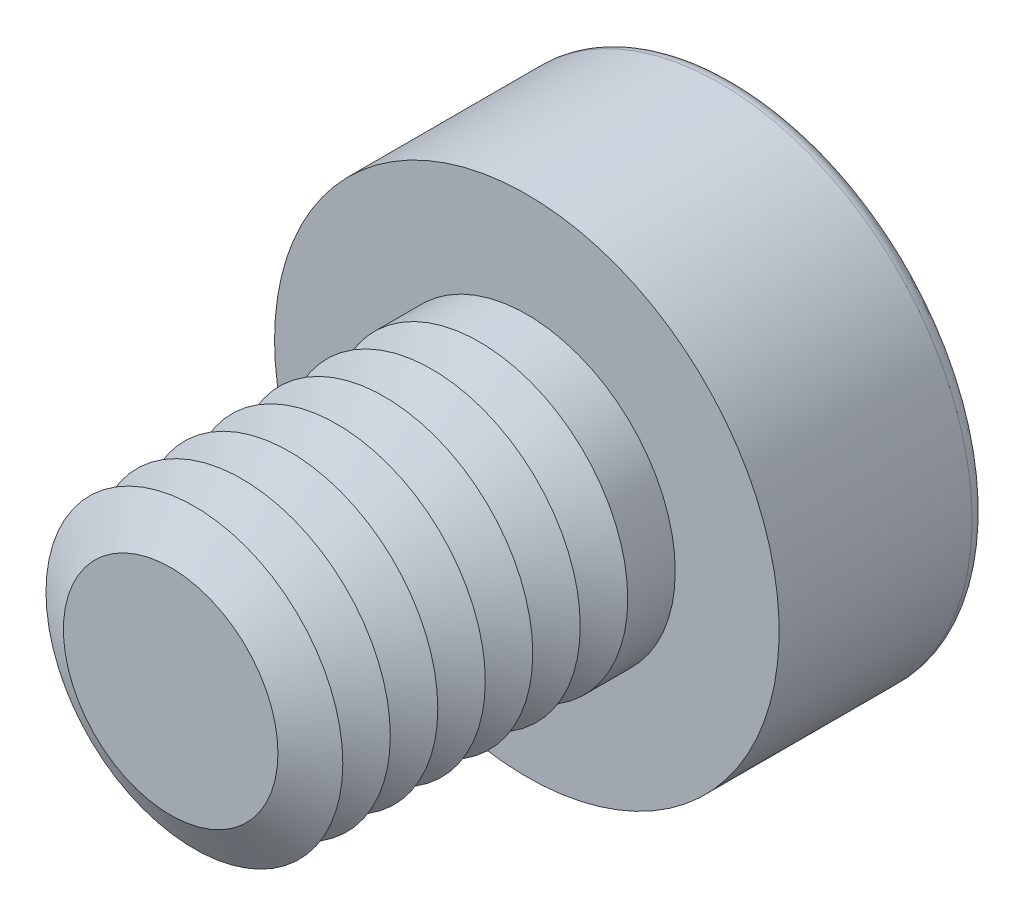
ISO-10303-21;
HEADER;
FILE_DESCRIPTION(('STEP AP214'),'2;1');
FILE_NAME('part.step','',(''),(''),'','','');
FILE_SCHEMA(('AUTOMOTIVE_DESIGN { 1 0 10303 214 1 1 1 1 }'));
ENDSEC;
DATA;
#1=APPLICATION_CONTEXT('core data for automotive mechanical design processes');
#2=APPLICATION_PROTOCOL_DEFINITION('international standard','automotive_design',2000,#1);
#3=PRODUCT_CONTEXT('',#1,'mechanical');
#4=PRODUCT('Part','Part','',(#3));
#5=PRODUCT_RELATED_PRODUCT_CATEGORY('part','',(#4));
#6=PRODUCT_DEFINITION_FORMATION('','',#4);
#7=PRODUCT_DEFINITION_CONTEXT('part definition',#1,'design');
#8=PRODUCT_DEFINITION('design','',#6,#7);
#9=PRODUCT_DEFINITION_SHAPE('','',#8);
#10=(LENGTH_UNIT() NAMED_UNIT(*) SI_UNIT(.MILLI.,.METRE.));
#11=(NAMED_UNIT(*) PLANE_ANGLE_UNIT() SI_UNIT($,.RADIAN.));
#12=(NAMED_UNIT(*) SI_UNIT($,.STERADIAN.) SOLID_ANGLE_UNIT());
#13=UNCERTAINTY_MEASURE_WITH_UNIT(LENGTH_MEASURE(1.E-05),#10,'distance_accuracy_value','');
#14=(GEOMETRIC_REPRESENTATION_CONTEXT(3) GLOBAL_UNCERTAINTY_ASSIGNED_CONTEXT((#13)) GLOBAL_UNIT_ASSIGNED_CONTEXT((#10,
#11,#12)) REPRESENTATION_CONTEXT('',''));
#15=CARTESIAN_POINT('',(0.,0.,0.));
#16=DIRECTION('',(0.,0.,1.));
#17=DIRECTION('',(1.,0.,0.));
#18=AXIS2_PLACEMENT_3D('',#15,#16,#17);
#19=CARTESIAN_POINT('',(0.,0.,3.2));
#20=DIRECTION('',(0.,0.,1.));
#21=DIRECTION('',(1.,0.,0.));
#22=AXIS2_PLACEMENT_3D('',#19,#20,#21);
#23=CONICAL_SURFACE('',#22,2.5,1.0471975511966);
#24=CARTESIAN_POINT('',(0.,0.,2.8));
#25=DIRECTION('',(0.,0.,1.));
#26=DIRECTION('',(1.,0.,0.));
#27=AXIS2_PLACEMENT_3D('',#24,#25,#26);
#28=CIRCLE('',#27,1.80717967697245);
#29=CARTESIAN_POINT('',(1.80717967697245,0.,2.8));
#30=VERTEX_POINT('',#29);
#31=EDGE_CURVE('E313',#30,#30,#28,.T.);
#32=ORIENTED_EDGE('',*,*,#31,.T.);
#33=EDGE_LOOP('',(#32));
#34=FACE_BOUND('',#33,.T.);
#35=CARTESIAN_POINT('',(0.,0.,3.2));
#36=DIRECTION('',(0.,0.,1.));
#37=DIRECTION('',(1.,0.,0.));
#38=AXIS2_PLACEMENT_3D('',#35,#36,#37);
#39=CIRCLE('',#38,2.5);
#40=CARTESIAN_POINT('',(2.5,0.,3.2));
#41=VERTEX_POINT('',#40);
#42=EDGE_CURVE('E315',#41,#41,#39,.T.);
#43=ORIENTED_EDGE('',*,*,#42,.F.);
#44=EDGE_LOOP('',(#43));
#45=FACE_BOUND('',#44,.T.);
#46=ADVANCED_FACE('F39',(#34,#45),#23,.T.);
#47=CARTESIAN_POINT('',(0.,0.,2.8));
#48=DIRECTION('',(0.,0.,-1.));
#49=DIRECTION('',(-1.,0.,0.));
#50=AXIS2_PLACEMENT_3D('',#47,#48,#49);
#51=CONICAL_SURFACE('',#50,1.80717967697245,1.04719755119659);
#52=CARTESIAN_POINT('',(0.,0.,2.4));
#53=DIRECTION('',(0.,0.,1.));
#54=DIRECTION('',(1.,0.,0.));
#55=AXIS2_PLACEMENT_3D('',#52,#53,#54);
#56=CIRCLE('',#55,2.5);
#57=CARTESIAN_POINT('',(2.5,0.,2.4));
#58=VERTEX_POINT('',#57);
#59=EDGE_CURVE('E323',#58,#58,#56,.T.);
#60=ORIENTED_EDGE('',*,*,#59,.T.);
#61=EDGE_LOOP('',(#60));
#62=FACE_BOUND('',#61,.T.);
#63=ORIENTED_EDGE('',*,*,#31,.F.);
#64=EDGE_LOOP('',(#63));
#65=FACE_BOUND('',#64,.T.);
#66=ADVANCED_FACE('F245',(#62,#65),#51,.T.);
#67=CARTESIAN_POINT('',(0.,0.,6.));
#68=DIRECTION('',(0.,0.,1.));
#69=DIRECTION('',(1.,0.,0.));
#70=AXIS2_PLACEMENT_3D('',#67,#68,#69);
#71=PLANE('',#70);
#72=CARTESIAN_POINT('',(0.,0.,6.));
#73=DIRECTION('',(0.,0.,1.));
#74=DIRECTION('',(1.,0.,0.));
#75=AXIS2_PLACEMENT_3D('',#72,#73,#74);
#76=CIRCLE('',#75,1.80717967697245);
#77=CARTESIAN_POINT('',(1.80717967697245,0.,6.));
#78=VERTEX_POINT('',#77);
#79=EDGE_CURVE('E174',#78,#78,#76,.T.);
#80=ORIENTED_EDGE('',*,*,#79,.T.);
#81=EDGE_LOOP('',(#80));
#82=FACE_BOUND('',#81,.T.);
#83=ADVANCED_FACE('F251',(#82),#71,.T.);
#84=CARTESIAN_POINT('',(0.,0.,6.));
#85=DIRECTION('',(0.,0.,-1.));
#86=DIRECTION('',(-1.,0.,0.));
#87=AXIS2_PLACEMENT_3D('',#84,#85,#86);
#88=CONICAL_SURFACE('',#87,1.80717967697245,1.04719755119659);
#89=CARTESIAN_POINT('',(0.,0.,5.6));
#90=DIRECTION('',(0.,0.,1.));
#91=DIRECTION('',(1.,0.,0.));
#92=AXIS2_PLACEMENT_3D('',#89,#90,#91);
#93=CIRCLE('',#92,2.5);
#94=CARTESIAN_POINT('',(2.5,0.,5.6));
#95=VERTEX_POINT('',#94);
#96=EDGE_CURVE('E291',#95,#95,#93,.T.);
#97=ORIENTED_EDGE('',*,*,#96,.T.);
#98=EDGE_LOOP('',(#97));
#99=FACE_BOUND('',#98,.T.);
#100=ORIENTED_EDGE('',*,*,#79,.F.);
#101=EDGE_LOOP('',(#100));
#102=FACE_BOUND('',#101,.T.);
#103=ADVANCED_FACE('F199',(#99,#102),#88,.T.);
#104=CARTESIAN_POINT('',(0.,0.,5.6));
#105=DIRECTION('',(0.,0.,1.));
#106=DIRECTION('',(1.,0.,0.));
#107=AXIS2_PLACEMENT_3D('',#104,#105,#106);
#108=CONICAL_SURFACE('',#107,2.5,1.0471975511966);
#109=CARTESIAN_POINT('',(0.,0.,5.2));
#110=DIRECTION('',(0.,0.,1.));
#111=DIRECTION('',(1.,0.,0.));
#112=AXIS2_PLACEMENT_3D('',#109,#110,#111);
#113=CIRCLE('',#112,1.80717967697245);
#114=CARTESIAN_POINT('',(1.80717967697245,0.,5.2));
#115=VERTEX_POINT('',#114);
#116=EDGE_CURVE('E288',#115,#115,#113,.T.);
#117=ORIENTED_EDGE('',*,*,#116,.T.);
#118=EDGE_LOOP('',(#117));
#119=FACE_BOUND('',#118,.T.);
#120=ORIENTED_EDGE('',*,*,#96,.F.);
#121=EDGE_LOOP('',(#120));
#122=FACE_BOUND('',#121,.T.);
#123=ADVANCED_FACE('F277',(#119,#122),#108,.T.);
#124=CARTESIAN_POINT('',(0.,0.,5.2));
#125=DIRECTION('',(0.,0.,-1.));
#126=DIRECTION('',(-1.,0.,0.));
#127=AXIS2_PLACEMENT_3D('',#124,#125,#126);
#128=CONICAL_SURFACE('',#127,1.80717967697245,1.04719755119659);
#129=CARTESIAN_POINT('',(0.,0.,4.8));
#130=DIRECTION('',(0.,0.,1.));
#131=DIRECTION('',(1.,0.,0.));
#132=AXIS2_PLACEMENT_3D('',#129,#130,#131);
#133=CIRCLE('',#132,2.5);
#134=CARTESIAN_POINT('',(2.5,0.,4.8));
#135=VERTEX_POINT('',#134);
#136=EDGE_CURVE('E299',#135,#135,#133,.T.);
#137=ORIENTED_EDGE('',*,*,#136,.T.);
#138=EDGE_LOOP('',(#137));
#139=FACE_BOUND('',#138,.T.);
#140=ORIENTED_EDGE('',*,*,#116,.F.);
#141=EDGE_LOOP('',(#140));
#142=FACE_BOUND('',#141,.T.);
#143=ADVANCED_FACE('F274',(#139,#142),#128,.T.);
#144=CARTESIAN_POINT('',(0.,0.,4.8));
#145=DIRECTION('',(0.,0.,1.));
#146=DIRECTION('',(1.,0.,0.));
#147=AXIS2_PLACEMENT_3D('',#144,#145,#146);
#148=CONICAL_SURFACE('',#147,2.5,1.0471975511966);
#149=CARTESIAN_POINT('',(0.,0.,4.4));
#150=DIRECTION('',(0.,0.,1.));
#151=DIRECTION('',(1.,0.,0.));
#152=AXIS2_PLACEMENT_3D('',#149,#150,#151);
#153=CIRCLE('',#152,1.80717967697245);
#154=CARTESIAN_POINT('',(1.80717967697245,0.,4.4));
#155=VERTEX_POINT('',#154);
#156=EDGE_CURVE('E293',#155,#155,#153,.T.);
#157=ORIENTED_EDGE('',*,*,#156,.T.);
#158=EDGE_LOOP('',(#157));
#159=FACE_BOUND('',#158,.T.);
#160=ORIENTED_EDGE('',*,*,#136,.F.);
#161=EDGE_LOOP('',(#160));
#162=FACE_BOUND('',#161,.T.);
#163=ADVANCED_FACE('F270',(#159,#162),#148,.T.);
#164=CARTESIAN_POINT('',(0.,0.,4.4));
#165=DIRECTION('',(0.,0.,-1.));
#166=DIRECTION('',(-1.,0.,0.));
#167=AXIS2_PLACEMENT_3D('',#164,#165,#166);
#168=CONICAL_SURFACE('',#167,1.80717967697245,1.04719755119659);
#169=CARTESIAN_POINT('',(0.,0.,4.));
#170=DIRECTION('',(0.,0.,1.));
#171=DIRECTION('',(1.,0.,0.));
#172=AXIS2_PLACEMENT_3D('',#169,#170,#171);
#173=CIRCLE('',#172,2.5);
#174=CARTESIAN_POINT('',(2.5,0.,4.));
#175=VERTEX_POINT('',#174);
#176=EDGE_CURVE('E309',#175,#175,#173,.T.);
#177=ORIENTED_EDGE('',*,*,#176,.T.);
#178=EDGE_LOOP('',(#177));
#179=FACE_BOUND('',#178,.T.);
#180=ORIENTED_EDGE('',*,*,#156,.F.);
#181=EDGE_LOOP('',(#180));
#182=FACE_BOUND('',#181,.T.);
#183=ADVANCED_FACE('F266',(#179,#182),#168,.T.);
#184=CARTESIAN_POINT('',(0.,0.,4.));
#185=DIRECTION('',(0.,0.,1.));
#186=DIRECTION('',(1.,0.,0.));
#187=AXIS2_PLACEMENT_3D('',#184,#185,#186);
#188=CONICAL_SURFACE('',#187,2.5,1.0471975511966);
#189=CARTESIAN_POINT('',(0.,0.,3.6));
#190=DIRECTION('',(0.,0.,1.));
#191=DIRECTION('',(1.,0.,0.));
#192=AXIS2_PLACEMENT_3D('',#189,#190,#191);
#193=CIRCLE('',#192,1.80717967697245);
#194=CARTESIAN_POINT('',(1.80717967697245,0.,3.6));
#195=VERTEX_POINT('',#194);
#196=EDGE_CURVE('E305',#195,#195,#193,.T.);
#197=ORIENTED_EDGE('',*,*,#196,.T.);
#198=EDGE_LOOP('',(#197));
#199=FACE_BOUND('',#198,.T.);
#200=ORIENTED_EDGE('',*,*,#176,.F.);
#201=EDGE_LOOP('',(#200));
#202=FACE_BOUND('',#201,.T.);
#203=ADVANCED_FACE('F262',(#199,#202),#188,.T.);
#204=CARTESIAN_POINT('',(0.,0.,3.6));
#205=DIRECTION('',(0.,0.,-1.));
#206=DIRECTION('',(-1.,0.,0.));
#207=AXIS2_PLACEMENT_3D('',#204,#205,#206);
#208=CONICAL_SURFACE('',#207,1.80717967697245,1.04719755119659);
#209=ORIENTED_EDGE('',*,*,#42,.T.);
#210=EDGE_LOOP('',(#209));
#211=FACE_BOUND('',#210,.T.);
#212=ORIENTED_EDGE('',*,*,#196,.F.);
#213=EDGE_LOOP('',(#212));
#214=FACE_BOUND('',#213,.T.);
#215=ADVANCED_FACE('F258',(#211,#214),#208,.T.);
#216=CARTESIAN_POINT('',(0.,0.,2.4));
#217=DIRECTION('',(0.,0.,1.));
#218=DIRECTION('',(1.,0.,0.));
#219=AXIS2_PLACEMENT_3D('',#216,#217,#218);
#220=CONICAL_SURFACE('',#219,2.5,1.0471975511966);
#221=CARTESIAN_POINT('',(0.,0.,2.));
#222=DIRECTION('',(0.,0.,1.));
#223=DIRECTION('',(1.,0.,0.));
#224=AXIS2_PLACEMENT_3D('',#221,#222,#223);
#225=CIRCLE('',#224,1.80717967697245);
#226=CARTESIAN_POINT('',(1.80717967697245,0.,2.));
#227=VERTEX_POINT('',#226);
#228=EDGE_CURVE('E319',#227,#227,#225,.T.);
#229=ORIENTED_EDGE('',*,*,#228,.T.);
#230=EDGE_LOOP('',(#229));
#231=FACE_BOUND('',#230,.T.);
#232=ORIENTED_EDGE('',*,*,#59,.F.);
#233=EDGE_LOOP('',(#232));
#234=FACE_BOUND('',#233,.T.);
#235=ADVANCED_FACE('F261',(#231,#234),#220,.T.);
#236=CARTESIAN_POINT('',(0.,0.,2.));
#237=DIRECTION('',(0.,0.,-1.));
#238=DIRECTION('',(-1.,0.,0.));
#239=AXIS2_PLACEMENT_3D('',#236,#237,#238);
#240=CONICAL_SURFACE('',#239,1.80717967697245,1.04719755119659);
#241=CARTESIAN_POINT('',(0.,0.,1.6));
#242=DIRECTION('',(0.,0.,1.));
#243=DIRECTION('',(1.,0.,0.));
#244=AXIS2_PLACEMENT_3D('',#241,#242,#243);
#245=CIRCLE('',#244,2.5);
#246=CARTESIAN_POINT('',(2.5,0.,1.6));
#247=VERTEX_POINT('',#246);
#248=EDGE_CURVE('E335',#247,#247,#245,.T.);
#249=ORIENTED_EDGE('',*,*,#248,.T.);
#250=EDGE_LOOP('',(#249));
#251=FACE_BOUND('',#250,.T.);
#252=ORIENTED_EDGE('',*,*,#228,.F.);
#253=EDGE_LOOP('',(#252));
#254=FACE_BOUND('',#253,.T.);
#255=ADVANCED_FACE('F341',(#251,#254),#240,.T.);
#256=CARTESIAN_POINT('',(0.,0.,1.6));
#257=DIRECTION('',(0.,0.,1.));
#258=DIRECTION('',(1.,0.,0.));
#259=AXIS2_PLACEMENT_3D('',#256,#257,#258);
#260=CONICAL_SURFACE('',#259,2.5,1.0471975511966);
#261=CARTESIAN_POINT('',(0.,0.,1.2));
#262=DIRECTION('',(0.,0.,1.));
#263=DIRECTION('',(1.,0.,0.));
#264=AXIS2_PLACEMENT_3D('',#261,#262,#263);
#265=CIRCLE('',#264,1.80717967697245);
#266=CARTESIAN_POINT('',(1.80717967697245,0.,1.2));
#267=VERTEX_POINT('',#266);
#268=EDGE_CURVE('E327',#267,#267,#265,.T.);
#269=ORIENTED_EDGE('',*,*,#268,.T.);
#270=EDGE_LOOP('',(#269));
#271=FACE_BOUND('',#270,.T.);
#272=ORIENTED_EDGE('',*,*,#248,.F.);
#273=EDGE_LOOP('',(#272));
#274=FACE_BOUND('',#273,.T.);
#275=ADVANCED_FACE('F344',(#271,#274),#260,.T.);
#276=CARTESIAN_POINT('',(0.,0.,1.2));
#277=DIRECTION('',(0.,0.,-1.));
#278=DIRECTION('',(-1.,0.,0.));
#279=AXIS2_PLACEMENT_3D('',#276,#277,#278);
#280=CONICAL_SURFACE('',#279,1.80717967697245,1.04719755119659);
#281=CARTESIAN_POINT('',(0.,0.,0.799999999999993));
#282=DIRECTION('',(0.,0.,1.));
#283=DIRECTION('',(1.,0.,0.));
#284=AXIS2_PLACEMENT_3D('',#281,#282,#283);
#285=CIRCLE('',#284,2.5);
#286=CARTESIAN_POINT('',(2.5,0.,0.799999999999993));
#287=VERTEX_POINT('',#286);
#288=EDGE_CURVE('E331',#287,#287,#285,.T.);
#289=ORIENTED_EDGE('',*,*,#288,.T.);
#290=EDGE_LOOP('',(#289));
#291=FACE_BOUND('',#290,.T.);
#292=ORIENTED_EDGE('',*,*,#268,.F.);
#293=EDGE_LOOP('',(#292));
#294=FACE_BOUND('',#293,.T.);
#295=ADVANCED_FACE('F346',(#291,#294),#280,.T.);
#296=CARTESIAN_POINT('',(0.,0.,-1.25));
#297=DIRECTION('',(0.,0.,-1.));
#298=DIRECTION('',(-1.,0.,0.));
#299=AXIS2_PLACEMENT_3D('',#296,#297,#298);
#300=CONICAL_SURFACE('',#299,1.5,1.0471975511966);
#301=CARTESIAN_POINT('',(0.,0.,-0.383974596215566));
#302=VERTEX_POINT('',#301);
#303=VERTEX_LOOP('',#302);
#304=FACE_BOUND('',#303,.T.);
#305=CARTESIAN_POINT('',(0.,0.,-1.25));
#306=DIRECTION('',(0.,0.,-1.));
#307=DIRECTION('',(-1.,0.,0.));
#308=AXIS2_PLACEMENT_3D('',#305,#306,#307);
#309=CIRCLE('',#308,1.5);
#310=CARTESIAN_POINT('',(-1.29903810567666,0.75,-1.25));
#311=VERTEX_POINT('',#310);
#312=CARTESIAN_POINT('',(0.,1.5,-1.25));
#313=VERTEX_POINT('',#312);
#314=EDGE_CURVE('E149',#311,#313,#309,.T.);
#315=ORIENTED_EDGE('',*,*,#314,.T.);
#316=CARTESIAN_POINT('',(0.,0.,-1.25));
#317=DIRECTION('',(0.,0.,-1.));
#318=DIRECTION('',(-1.,0.,0.));
#319=AXIS2_PLACEMENT_3D('',#316,#317,#318);
#320=CIRCLE('',#319,1.5);
#321=CARTESIAN_POINT('',(1.29903810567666,0.75,-1.25));
#322=VERTEX_POINT('',#321);
#323=EDGE_CURVE('E54',#313,#322,#320,.T.);
#324=ORIENTED_EDGE('',*,*,#323,.T.);
#325=CARTESIAN_POINT('',(1.29903810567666,-0.749999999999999,-1.25));
#326=VERTEX_POINT('',#325);
#327=EDGE_CURVE('E725',#322,#326,#320,.T.);
#328=ORIENTED_EDGE('',*,*,#327,.T.);
#329=CARTESIAN_POINT('',(0.,-1.5,-1.25));
#330=VERTEX_POINT('',#329);
#331=EDGE_CURVE('E724',#326,#330,#320,.T.);
#332=ORIENTED_EDGE('',*,*,#331,.T.);
#333=CARTESIAN_POINT('',(-1.29903810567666,-0.75,-1.25));
#334=VERTEX_POINT('',#333);
#335=EDGE_CURVE('E719',#330,#334,#320,.T.);
#336=ORIENTED_EDGE('',*,*,#335,.T.);
#337=EDGE_CURVE('E717',#334,#311,#320,.T.);
#338=ORIENTED_EDGE('',*,*,#337,.T.);
#339=EDGE_LOOP('',(#315,#324,#328,#332,#336,#338));
#340=FACE_BOUND('',#339,.T.);
#341=ADVANCED_FACE('F201',(#304,#340),#300,.F.);
#342=CARTESIAN_POINT('',(0.,0.,-1.25));
#343=DIRECTION('',(0.,0.,-1.));
#344=DIRECTION('',(-1.,0.,0.));
#345=AXIS2_PLACEMENT_3D('',#342,#343,#344);
#346=PLANE('',#345);
#347=ORIENTED_EDGE('',*,*,#323,.F.);
#348=DIRECTION('',(1.,0.,0.));
#349=VECTOR('',#348,1.);
#350=CARTESIAN_POINT('',(-0.86602540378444,1.5,-1.25));
#351=LINE('',#350,#349);
#352=CARTESIAN_POINT('',(0.866025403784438,1.5,-1.25));
#353=VERTEX_POINT('',#352);
#354=EDGE_CURVE('E769',#313,#353,#351,.T.);
#355=ORIENTED_EDGE('',*,*,#354,.T.);
#356=DIRECTION('',(0.5,-0.866025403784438,0.));
#357=VECTOR('',#356,1.);
#358=CARTESIAN_POINT('',(0.866025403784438,1.5,-1.25));
#359=LINE('',#358,#357);
#360=EDGE_CURVE('E155',#353,#322,#359,.T.);
#361=ORIENTED_EDGE('',*,*,#360,.T.);
#362=EDGE_LOOP('',(#347,#355,#361));
#363=FACE_BOUND('',#362,.T.);
#364=ADVANCED_FACE('F386',(#363),#346,.T.);
#365=ORIENTED_EDGE('',*,*,#327,.F.);
#366=CARTESIAN_POINT('',(1.73205080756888,0.,-1.25));
#367=VERTEX_POINT('',#366);
#368=EDGE_CURVE('E765',#322,#367,#359,.T.);
#369=ORIENTED_EDGE('',*,*,#368,.T.);
#370=DIRECTION('',(-0.5,-0.866025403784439,0.));
#371=VECTOR('',#370,1.);
#372=CARTESIAN_POINT('',(1.73205080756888,0.,-1.25));
#373=LINE('',#372,#371);
#374=EDGE_CURVE('E738',#367,#326,#373,.T.);
#375=ORIENTED_EDGE('',*,*,#374,.T.);
#376=EDGE_LOOP('',(#365,#369,#375));
#377=FACE_BOUND('',#376,.T.);
#378=ADVANCED_FACE('F396',(#377),#346,.T.);
#379=ORIENTED_EDGE('',*,*,#331,.F.);
#380=CARTESIAN_POINT('',(0.866025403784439,-1.5,-1.25));
#381=VERTEX_POINT('',#380);
#382=EDGE_CURVE('E740',#326,#381,#373,.T.);
#383=ORIENTED_EDGE('',*,*,#382,.T.);
#384=DIRECTION('',(-1.,0.,0.));
#385=VECTOR('',#384,1.);
#386=CARTESIAN_POINT('',(0.866025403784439,-1.5,-1.25));
#387=LINE('',#386,#385);
#388=EDGE_CURVE('E695',#381,#330,#387,.T.);
#389=ORIENTED_EDGE('',*,*,#388,.T.);
#390=EDGE_LOOP('',(#379,#383,#389));
#391=FACE_BOUND('',#390,.T.);
#392=ADVANCED_FACE('F406',(#391),#346,.T.);
#393=ORIENTED_EDGE('',*,*,#335,.F.);
#394=CARTESIAN_POINT('',(-0.866025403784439,-1.5,-1.25));
#395=VERTEX_POINT('',#394);
#396=EDGE_CURVE('E735',#330,#395,#387,.T.);
#397=ORIENTED_EDGE('',*,*,#396,.T.);
#398=DIRECTION('',(-0.5,0.866025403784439,0.));
#399=VECTOR('',#398,1.);
#400=CARTESIAN_POINT('',(-0.866025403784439,-1.5,-1.25));
#401=LINE('',#400,#399);
#402=EDGE_CURVE('E737',#395,#334,#401,.T.);
#403=ORIENTED_EDGE('',*,*,#402,.T.);
#404=EDGE_LOOP('',(#393,#397,#403));
#405=FACE_BOUND('',#404,.T.);
#406=ADVANCED_FACE('F414',(#405),#346,.T.);
#407=ORIENTED_EDGE('',*,*,#337,.F.);
#408=CARTESIAN_POINT('',(-1.73205080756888,0.,-1.25));
#409=VERTEX_POINT('',#408);
#410=EDGE_CURVE('E742',#334,#409,#401,.T.);
#411=ORIENTED_EDGE('',*,*,#410,.T.);
#412=DIRECTION('',(0.5,0.866025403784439,0.));
#413=VECTOR('',#412,1.);
#414=CARTESIAN_POINT('',(-1.73205080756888,0.,-1.25));
#415=LINE('',#414,#413);
#416=EDGE_CURVE('E158',#409,#311,#415,.T.);
#417=ORIENTED_EDGE('',*,*,#416,.T.);
#418=EDGE_LOOP('',(#407,#411,#417));
#419=FACE_BOUND('',#418,.T.);
#420=ADVANCED_FACE('F231',(#419),#346,.T.);
#421=ORIENTED_EDGE('',*,*,#314,.F.);
#422=CARTESIAN_POINT('',(-0.86602540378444,1.5,-1.25));
#423=VERTEX_POINT('',#422);
#424=EDGE_CURVE('E749',#311,#423,#415,.T.);
#425=ORIENTED_EDGE('',*,*,#424,.T.);
#426=EDGE_CURVE('E766',#423,#313,#351,.T.);
#427=ORIENTED_EDGE('',*,*,#426,.T.);
#428=EDGE_LOOP('',(#421,#425,#427));
#429=FACE_BOUND('',#428,.T.);
#430=ADVANCED_FACE('F398',(#429),#346,.T.);
#431=CARTESIAN_POINT('',(-0.86602540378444,1.5,-1.25));
#432=DIRECTION('',(0.,1.,0.));
#433=DIRECTION('',(0.,0.,1.));
#434=AXIS2_PLACEMENT_3D('',#431,#432,#433);
#435=PLANE('',#434);
#436=DIRECTION('',(0.,0.,-1.));
#437=VECTOR('',#436,1.);
#438=CARTESIAN_POINT('',(-0.86602540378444,1.5,-1.25));
#439=LINE('',#438,#437);
#440=CARTESIAN_POINT('',(-0.86602540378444,1.5,-3.5));
#441=VERTEX_POINT('',#440);
#442=EDGE_CURVE('E147',#423,#441,#439,.T.);
#443=ORIENTED_EDGE('',*,*,#442,.T.);
#444=CARTESIAN_POINT('',(-2.26080568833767,1.5,-3.76288767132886));
#445=CARTESIAN_POINT('',(-2.19307335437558,1.5,-3.74776718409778));
#446=CARTESIAN_POINT('',(-2.12529797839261,1.5,-3.73283936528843));
#447=CARTESIAN_POINT('',(-1.989639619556,1.5,-3.7034664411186));
#448=CARTESIAN_POINT('',(-1.92175663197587,1.5,-3.6890213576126));
#449=CARTESIAN_POINT('',(-1.71778516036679,1.5,-3.6465295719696));
#450=CARTESIAN_POINT('',(-1.58151166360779,1.5,-3.61935744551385));
#451=CARTESIAN_POINT('',(-1.30947840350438,1.5,-3.56878855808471));
#452=CARTESIAN_POINT('',(-1.17372447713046,1.5,-3.54536102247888));
#453=CARTESIAN_POINT('',(-0.901404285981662,1.5,-3.50385032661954));
#454=CARTESIAN_POINT('',(-0.764838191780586,1.5,-3.48576608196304));
#455=CARTESIAN_POINT('',(-0.489293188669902,1.5,-3.45729203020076));
#456=CARTESIAN_POINT('',(-0.350304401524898,1.5,-3.44699084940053));
#457=CARTESIAN_POINT('',(-0.141571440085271,1.5,-3.43918165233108));
#458=CARTESIAN_POINT('',(-0.0719628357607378,1.5,-3.43785196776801));
#459=CARTESIAN_POINT('',(0.0672555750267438,1.5,-3.43779336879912));
#460=CARTESIAN_POINT('',(0.136865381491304,1.5,-3.43906445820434));
#461=CARTESIAN_POINT('',(0.346114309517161,1.5,-3.44672257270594));
#462=CARTESIAN_POINT('',(0.485619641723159,1.5,-3.45697478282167));
#463=CARTESIAN_POINT('',(0.763829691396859,1.5,-3.48560011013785));
#464=CARTESIAN_POINT('',(0.90253376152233,1.5,-3.50397905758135));
#465=CARTESIAN_POINT('',(1.18270277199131,1.5,-3.54677522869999));
#466=CARTESIAN_POINT('',(1.32414472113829,1.5,-3.57133816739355));
#467=CARTESIAN_POINT('',(1.60634089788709,1.5,-3.62417713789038));
#468=CARTESIAN_POINT('',(1.74709501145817,1.5,-3.65245376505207));
#469=CARTESIAN_POINT('',(2.02813527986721,1.5,-3.71141289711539));
#470=CARTESIAN_POINT('',(2.16842128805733,1.5,-3.74209609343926));
#471=CARTESIAN_POINT('',(2.44863558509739,1.5,-3.80505759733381));
#472=CARTESIAN_POINT('',(2.5885638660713,1.5,-3.8373359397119));
#473=CARTESIAN_POINT('',(2.86645602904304,1.5,-3.90258693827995));
#474=CARTESIAN_POINT('',(3.0044230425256,1.5,-3.93554631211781));
#475=CARTESIAN_POINT('',(3.28017563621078,1.5,-4.00222717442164));
#476=CARTESIAN_POINT('',(3.41796121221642,1.5,-4.03594868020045));
#477=CARTESIAN_POINT('',(3.69320305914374,1.5,-4.10389962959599));
#478=CARTESIAN_POINT('',(3.83065952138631,1.5,-4.13812829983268));
#479=CARTESIAN_POINT('',(4.10546119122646,1.5,-4.20700872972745));
#480=CARTESIAN_POINT('',(4.24280640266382,1.5,-4.2416604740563));
#481=CARTESIAN_POINT('',(4.38011382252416,1.5,-4.27645965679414));
#482=B_SPLINE_CURVE_WITH_KNOTS('',3,(#444,#445,#446,#447,#448,#449,#450,#451,#452,#453,#454,
#455,#456,#457,#458,#459,#460,#461,#462,#463,#464,#465,#466,#467,#468,#469,#470,#471,#472,#473,
#474,#475,#476,#477,#478,#479,#480,#481),.UNSPECIFIED.,.F.,.F.,(4,2,2,2,2,2,2,2,2,2,2,2,2,2,2,2,
2,2,4),(0.,0.208198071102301,0.416405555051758,0.833243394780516,1.2464565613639,
1.65958581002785,2.07735129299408,2.28617008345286,2.49498917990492,2.91428402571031,
3.33388016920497,3.76448033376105,4.19514961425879,4.62594308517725,5.05674596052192,
5.48229088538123,5.90784548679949,6.33280701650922,6.75775319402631),.UNSPECIFIED.);
#483=CARTESIAN_POINT('',(0.866025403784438,1.5,-3.5));
#484=VERTEX_POINT('',#483);
#485=EDGE_CURVE('E124',#441,#484,#482,.T.);
#486=ORIENTED_EDGE('',*,*,#485,.T.);
#487=DIRECTION('',(0.,0.,-1.));
#488=VECTOR('',#487,1.);
#489=CARTESIAN_POINT('',(0.866025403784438,1.5,-1.25));
#490=LINE('',#489,#488);
#491=EDGE_CURVE('E143',#353,#484,#490,.T.);
#492=ORIENTED_EDGE('',*,*,#491,.F.);
#493=ORIENTED_EDGE('',*,*,#354,.F.);
#494=ORIENTED_EDGE('',*,*,#426,.F.);
#495=EDGE_LOOP('',(#443,#486,#492,#493,#494));
#496=FACE_BOUND('',#495,.T.);
#497=ADVANCED_FACE('F141',(#496),#435,.F.);
#498=CARTESIAN_POINT('',(0.866025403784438,1.5,-1.25));
#499=DIRECTION('',(0.866025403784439,0.5,0.));
#500=DIRECTION('',(-0.5,0.866025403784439,0.));
#501=AXIS2_PLACEMENT_3D('',#498,#499,#500);
#502=PLANE('',#501);
#503=ORIENTED_EDGE('',*,*,#491,.T.);
#504=CARTESIAN_POINT('',(0.8659099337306,1.5002,-3.50003094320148));
#505=CARTESIAN_POINT('',(0.901883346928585,1.43789222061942,-3.49038632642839));
#506=CARTESIAN_POINT('',(0.937921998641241,1.37547144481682,-3.48163049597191));
#507=CARTESIAN_POINT('',(1.01012661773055,1.25040937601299,-3.46624719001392));
#508=CARTESIAN_POINT('',(1.04629263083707,1.18776800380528,-3.4596205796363));
#509=CARTESIAN_POINT('',(1.11853262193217,1.06264466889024,-3.44888268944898));
#510=CARTESIAN_POINT('',(1.15460611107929,1.00016355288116,-3.44475860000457));
#511=CARTESIAN_POINT('',(1.22679910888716,0.875121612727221,-3.43922860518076));
#512=CARTESIAN_POINT('',(1.26291860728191,0.812560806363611,-3.43782217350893));
#513=CARTESIAN_POINT('',(1.33515760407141,0.68743919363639,-3.43782217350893));
#514=CARTESIAN_POINT('',(1.37127710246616,0.624878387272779,-3.43922860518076));
#515=CARTESIAN_POINT('',(1.44347010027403,0.49983644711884,-3.44475860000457));
#516=CARTESIAN_POINT('',(1.47954358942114,0.437355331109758,-3.44888268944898));
#517=CARTESIAN_POINT('',(1.55178358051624,0.312231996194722,-3.4596205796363));
#518=CARTESIAN_POINT('',(1.58794959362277,0.249590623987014,-3.46624719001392));
#519=CARTESIAN_POINT('',(1.66015421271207,0.124528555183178,-3.48163049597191));
#520=CARTESIAN_POINT('',(1.69619286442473,0.0621077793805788,-3.49038632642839));
#521=CARTESIAN_POINT('',(1.73216627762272,-0.00019999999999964,-3.50003094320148));
#522=B_SPLINE_CURVE_WITH_KNOTS('',3,(#504,#505,#506,#507,#508,#509,#510,#511,#512,#513,#514,
#515,#516,#517,#518,#519,#520,#521),.UNSPECIFIED.,.F.,.F.,(4,2,2,2,2,2,2,2,4),(0.,
0.217782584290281,0.435653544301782,0.652399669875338,0.869103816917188,1.08580796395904,
1.30255408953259,1.52042504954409,1.73820763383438),.UNSPECIFIED.);
#523=CARTESIAN_POINT('',(1.73205080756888,0.,-3.5));
#524=VERTEX_POINT('',#523);
#525=EDGE_CURVE('E11',#484,#524,#522,.T.);
#526=ORIENTED_EDGE('',*,*,#525,.T.);
#527=DIRECTION('',(0.,0.,-1.));
#528=VECTOR('',#527,1.);
#529=CARTESIAN_POINT('',(1.73205080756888,0.,-1.25));
#530=LINE('',#529,#528);
#531=EDGE_CURVE('E157',#367,#524,#530,.T.);
#532=ORIENTED_EDGE('',*,*,#531,.F.);
#533=ORIENTED_EDGE('',*,*,#368,.F.);
#534=ORIENTED_EDGE('',*,*,#360,.F.);
#535=EDGE_LOOP('',(#503,#526,#532,#533,#534));
#536=FACE_BOUND('',#535,.T.);
#537=ADVANCED_FACE('F152',(#536),#502,.F.);
#538=CARTESIAN_POINT('',(1.73205080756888,0.,-1.25));
#539=DIRECTION('',(0.866025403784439,-0.5,0.));
#540=DIRECTION('',(0.5,0.866025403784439,0.));
#541=AXIS2_PLACEMENT_3D('',#538,#539,#540);
#542=PLANE('',#541);
#543=ORIENTED_EDGE('',*,*,#531,.T.);
#544=CARTESIAN_POINT('',(1.73216627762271,0.000200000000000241,-3.50003094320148));
#545=CARTESIAN_POINT('',(1.69619286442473,-0.0621077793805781,-3.49038632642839));
#546=CARTESIAN_POINT('',(1.66015421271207,-0.124528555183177,-3.48163049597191));
#547=CARTESIAN_POINT('',(1.58794959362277,-0.249590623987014,-3.46624719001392));
#548=CARTESIAN_POINT('',(1.55178358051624,-0.312231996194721,-3.4596205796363));
#549=CARTESIAN_POINT('',(1.47954358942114,-0.437355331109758,-3.44888268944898));
#550=CARTESIAN_POINT('',(1.44347010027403,-0.499836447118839,-3.44475860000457));
#551=CARTESIAN_POINT('',(1.37127710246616,-0.624878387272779,-3.43922860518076));
#552=CARTESIAN_POINT('',(1.33515760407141,-0.687439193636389,-3.43782217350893));
#553=CARTESIAN_POINT('',(1.26291860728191,-0.81256080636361,-3.43782217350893));
#554=CARTESIAN_POINT('',(1.22679910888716,-0.87512161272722,-3.43922860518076));
#555=CARTESIAN_POINT('',(1.15460611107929,-1.00016355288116,-3.44475860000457));
#556=CARTESIAN_POINT('',(1.11853262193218,-1.06264466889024,-3.44888268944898));
#557=CARTESIAN_POINT('',(1.04629263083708,-1.18776800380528,-3.4596205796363));
#558=CARTESIAN_POINT('',(1.01012661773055,-1.25040937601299,-3.46624719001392));
#559=CARTESIAN_POINT('',(0.937921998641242,-1.37547144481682,-3.48163049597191));
#560=CARTESIAN_POINT('',(0.901883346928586,-1.43789222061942,-3.49038632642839));
#561=CARTESIAN_POINT('',(0.865909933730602,-1.5002,-3.50003094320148));
#562=B_SPLINE_CURVE_WITH_KNOTS('',3,(#544,#545,#546,#547,#548,#549,#550,#551,#552,#553,#554,
#555,#556,#557,#558,#559,#560,#561),.UNSPECIFIED.,.F.,.F.,(4,2,2,2,2,2,2,2,4),(0.,
0.217782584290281,0.435653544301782,0.652399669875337,0.869103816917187,1.08580796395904,
1.30255408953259,1.52042504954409,1.73820763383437),.UNSPECIFIED.);
#563=CARTESIAN_POINT('',(0.866025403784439,-1.5,-3.5));
#564=VERTEX_POINT('',#563);
#565=EDGE_CURVE('E173',#524,#564,#562,.T.);
#566=ORIENTED_EDGE('',*,*,#565,.T.);
#567=DIRECTION('',(0.,0.,-1.));
#568=VECTOR('',#567,1.);
#569=CARTESIAN_POINT('',(0.866025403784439,-1.5,-1.25));
#570=LINE('',#569,#568);
#571=EDGE_CURVE('E690',#381,#564,#570,.T.);
#572=ORIENTED_EDGE('',*,*,#571,.F.);
#573=ORIENTED_EDGE('',*,*,#382,.F.);
#574=ORIENTED_EDGE('',*,*,#374,.F.);
#575=EDGE_LOOP('',(#543,#566,#572,#573,#574));
#576=FACE_BOUND('',#575,.T.);
#577=ADVANCED_FACE('F191',(#576),#542,.F.);
#578=CARTESIAN_POINT('',(0.866025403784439,-1.5,-1.25));
#579=DIRECTION('',(0.,-1.,0.));
#580=DIRECTION('',(0.,0.,-1.));
#581=AXIS2_PLACEMENT_3D('',#578,#579,#580);
#582=PLANE('',#581);
#583=ORIENTED_EDGE('',*,*,#571,.T.);
#584=CARTESIAN_POINT('',(-2.26080568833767,-1.5,-3.76288767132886));
#585=CARTESIAN_POINT('',(-2.19307335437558,-1.5,-3.74776718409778));
#586=CARTESIAN_POINT('',(-2.12529797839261,-1.5,-3.73283936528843));
#587=CARTESIAN_POINT('',(-1.989639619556,-1.5,-3.7034664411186));
#588=CARTESIAN_POINT('',(-1.92175663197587,-1.5,-3.6890213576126));
#589=CARTESIAN_POINT('',(-1.71778516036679,-1.5,-3.6465295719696));
#590=CARTESIAN_POINT('',(-1.58151166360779,-1.5,-3.61935744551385));
#591=CARTESIAN_POINT('',(-1.30947840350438,-1.5,-3.56878855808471));
#592=CARTESIAN_POINT('',(-1.17372447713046,-1.5,-3.54536102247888));
#593=CARTESIAN_POINT('',(-0.901404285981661,-1.5,-3.50385032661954));
#594=CARTESIAN_POINT('',(-0.764838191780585,-1.5,-3.48576608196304));
#595=CARTESIAN_POINT('',(-0.489293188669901,-1.5,-3.45729203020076));
#596=CARTESIAN_POINT('',(-0.350304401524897,-1.5,-3.44699084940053));
#597=CARTESIAN_POINT('',(-0.14157144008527,-1.5,-3.43918165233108));
#598=CARTESIAN_POINT('',(-0.071962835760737,-1.5,-3.43785196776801));
#599=CARTESIAN_POINT('',(0.0672555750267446,-1.5,-3.43779336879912));
#600=CARTESIAN_POINT('',(0.136865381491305,-1.5,-3.43906445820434));
#601=CARTESIAN_POINT('',(0.346114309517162,-1.5,-3.44672257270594));
#602=CARTESIAN_POINT('',(0.48561964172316,-1.5,-3.45697478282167));
#603=CARTESIAN_POINT('',(0.76382969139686,-1.5,-3.48560011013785));
#604=CARTESIAN_POINT('',(0.902533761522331,-1.5,-3.50397905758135));
#605=CARTESIAN_POINT('',(1.18270277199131,-1.5,-3.54677522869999));
#606=CARTESIAN_POINT('',(1.32414472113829,-1.5,-3.57133816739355));
#607=CARTESIAN_POINT('',(1.60634089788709,-1.5,-3.62417713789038));
#608=CARTESIAN_POINT('',(1.74709501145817,-1.5,-3.65245376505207));
#609=CARTESIAN_POINT('',(2.02813527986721,-1.5,-3.71141289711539));
#610=CARTESIAN_POINT('',(2.16842128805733,-1.5,-3.74209609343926));
#611=CARTESIAN_POINT('',(2.44863558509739,-1.5,-3.80505759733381));
#612=CARTESIAN_POINT('',(2.5885638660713,-1.5,-3.8373359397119));
#613=CARTESIAN_POINT('',(2.86645602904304,-1.5,-3.90258693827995));
#614=CARTESIAN_POINT('',(3.0044230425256,-1.5,-3.93554631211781));
#615=CARTESIAN_POINT('',(3.28017563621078,-1.5,-4.00222717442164));
#616=CARTESIAN_POINT('',(3.41796121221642,-1.5,-4.03594868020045));
#617=CARTESIAN_POINT('',(3.69320305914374,-1.5,-4.10389962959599));
#618=CARTESIAN_POINT('',(3.83065952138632,-1.5,-4.13812829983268));
#619=CARTESIAN_POINT('',(4.10546119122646,-1.5,-4.20700872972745));
#620=CARTESIAN_POINT('',(4.24280640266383,-1.5,-4.2416604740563));
#621=CARTESIAN_POINT('',(4.38011382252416,-1.5,-4.27645965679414));
#622=B_SPLINE_CURVE_WITH_KNOTS('',3,(#584,#585,#586,#587,#588,#589,#590,#591,#592,#593,#594,
#595,#596,#597,#598,#599,#600,#601,#602,#603,#604,#605,#606,#607,#608,#609,#610,#611,#612,#613,
#614,#615,#616,#617,#618,#619,#620,#621),.UNSPECIFIED.,.F.,.F.,(4,2,2,2,2,2,2,2,2,2,2,2,2,2,2,2,
2,2,4),(0.,0.208198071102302,0.416405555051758,0.833243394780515,1.2464565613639,
1.65958581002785,2.07735129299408,2.28617008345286,2.49498917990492,2.91428402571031,
3.33388016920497,3.76448033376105,4.19514961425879,4.62594308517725,5.05674596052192,
5.48229088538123,5.90784548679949,6.33280701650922,6.75775319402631),.UNSPECIFIED.);
#623=CARTESIAN_POINT('',(-0.866025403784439,-1.5,-3.5));
#624=VERTEX_POINT('',#623);
#625=EDGE_CURVE('E184',#564,#624,#622,.F.);
#626=ORIENTED_EDGE('',*,*,#625,.T.);
#627=DIRECTION('',(0.,0.,-1.));
#628=VECTOR('',#627,1.);
#629=CARTESIAN_POINT('',(-0.866025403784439,-1.5,-1.25));
#630=LINE('',#629,#628);
#631=EDGE_CURVE('E696',#395,#624,#630,.T.);
#632=ORIENTED_EDGE('',*,*,#631,.F.);
#633=ORIENTED_EDGE('',*,*,#396,.F.);
#634=ORIENTED_EDGE('',*,*,#388,.F.);
#635=EDGE_LOOP('',(#583,#626,#632,#633,#634));
#636=FACE_BOUND('',#635,.T.);
#637=ADVANCED_FACE('F234',(#636),#582,.F.);
#638=CARTESIAN_POINT('',(-0.866025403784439,-1.5,-1.25));
#639=DIRECTION('',(-0.866025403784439,-0.5,0.));
#640=DIRECTION('',(0.5,-0.866025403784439,0.));
#641=AXIS2_PLACEMENT_3D('',#638,#639,#640);
#642=PLANE('',#641);
#643=ORIENTED_EDGE('',*,*,#631,.T.);
#644=CARTESIAN_POINT('',(-0.865909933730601,-1.5002,-3.50003094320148));
#645=CARTESIAN_POINT('',(-0.901883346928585,-1.43789222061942,-3.49038632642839));
#646=CARTESIAN_POINT('',(-0.937921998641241,-1.37547144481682,-3.48163049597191));
#647=CARTESIAN_POINT('',(-1.01012661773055,-1.25040937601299,-3.46624719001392));
#648=CARTESIAN_POINT('',(-1.04629263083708,-1.18776800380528,-3.4596205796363));
#649=CARTESIAN_POINT('',(-1.11853262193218,-1.06264466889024,-3.44888268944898));
#650=CARTESIAN_POINT('',(-1.15460611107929,-1.00016355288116,-3.44475860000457));
#651=CARTESIAN_POINT('',(-1.22679910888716,-0.87512161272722,-3.43922860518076));
#652=CARTESIAN_POINT('',(-1.26291860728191,-0.81256080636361,-3.43782217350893));
#653=CARTESIAN_POINT('',(-1.33515760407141,-0.687439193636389,-3.43782217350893));
#654=CARTESIAN_POINT('',(-1.37127710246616,-0.624878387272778,-3.43922860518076));
#655=CARTESIAN_POINT('',(-1.44347010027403,-0.499836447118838,-3.44475860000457));
#656=CARTESIAN_POINT('',(-1.47954358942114,-0.437355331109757,-3.44888268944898));
#657=CARTESIAN_POINT('',(-1.55178358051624,-0.31223199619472,-3.4596205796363));
#658=CARTESIAN_POINT('',(-1.58794959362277,-0.249590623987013,-3.46624719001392));
#659=CARTESIAN_POINT('',(-1.66015421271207,-0.124528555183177,-3.48163049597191));
#660=CARTESIAN_POINT('',(-1.69619286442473,-0.0621077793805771,-3.49038632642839));
#661=CARTESIAN_POINT('',(-1.73216627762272,0.000200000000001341,-3.50003094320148));
#662=B_SPLINE_CURVE_WITH_KNOTS('',3,(#644,#645,#646,#647,#648,#649,#650,#651,#652,#653,#654,
#655,#656,#657,#658,#659,#660,#661),.UNSPECIFIED.,.F.,.F.,(4,2,2,2,2,2,2,2,4),(0.,
0.217782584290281,0.435653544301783,0.652399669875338,0.869103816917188,1.08580796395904,
1.30255408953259,1.52042504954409,1.73820763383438),.UNSPECIFIED.);
#663=CARTESIAN_POINT('',(-1.73205080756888,0.,-3.5));
#664=VERTEX_POINT('',#663);
#665=EDGE_CURVE('E208',#624,#664,#662,.T.);
#666=ORIENTED_EDGE('',*,*,#665,.T.);
#667=DIRECTION('',(0.,0.,-1.));
#668=VECTOR('',#667,1.);
#669=CARTESIAN_POINT('',(-1.73205080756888,0.,-1.25));
#670=LINE('',#669,#668);
#671=EDGE_CURVE('E698',#409,#664,#670,.T.);
#672=ORIENTED_EDGE('',*,*,#671,.F.);
#673=ORIENTED_EDGE('',*,*,#410,.F.);
#674=ORIENTED_EDGE('',*,*,#402,.F.);
#675=EDGE_LOOP('',(#643,#666,#672,#673,#674));
#676=FACE_BOUND('',#675,.T.);
#677=ADVANCED_FACE('F229',(#676),#642,.F.);
#678=CARTESIAN_POINT('',(-1.73205080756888,0.,-1.25));
#679=DIRECTION('',(-0.866025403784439,0.5,0.));
#680=DIRECTION('',(-0.5,-0.866025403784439,0.));
#681=AXIS2_PLACEMENT_3D('',#678,#679,#680);
#682=PLANE('',#681);
#683=ORIENTED_EDGE('',*,*,#671,.T.);
#684=CARTESIAN_POINT('',(-1.73216627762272,-0.000199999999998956,-3.50003094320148));
#685=CARTESIAN_POINT('',(-1.69619286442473,0.0621077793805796,-3.49038632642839));
#686=CARTESIAN_POINT('',(-1.66015421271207,0.124528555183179,-3.48163049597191));
#687=CARTESIAN_POINT('',(-1.58794959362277,0.249590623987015,-3.46624719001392));
#688=CARTESIAN_POINT('',(-1.55178358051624,0.312231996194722,-3.4596205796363));
#689=CARTESIAN_POINT('',(-1.47954358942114,0.437355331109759,-3.44888268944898));
#690=CARTESIAN_POINT('',(-1.44347010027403,0.49983644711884,-3.44475860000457));
#691=CARTESIAN_POINT('',(-1.37127710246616,0.62487838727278,-3.43922860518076));
#692=CARTESIAN_POINT('',(-1.33515760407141,0.68743919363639,-3.43782217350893));
#693=CARTESIAN_POINT('',(-1.26291860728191,0.812560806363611,-3.43782217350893));
#694=CARTESIAN_POINT('',(-1.22679910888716,0.875121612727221,-3.43922860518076));
#695=CARTESIAN_POINT('',(-1.15460611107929,1.00016355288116,-3.44475860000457));
#696=CARTESIAN_POINT('',(-1.11853262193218,1.06264466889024,-3.44888268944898));
#697=CARTESIAN_POINT('',(-1.04629263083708,1.18776800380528,-3.4596205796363));
#698=CARTESIAN_POINT('',(-1.01012661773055,1.25040937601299,-3.46624719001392));
#699=CARTESIAN_POINT('',(-0.937921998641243,1.37547144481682,-3.48163049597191));
#700=CARTESIAN_POINT('',(-0.901883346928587,1.43789222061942,-3.49038632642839));
#701=CARTESIAN_POINT('',(-0.865909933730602,1.5002,-3.50003094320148));
#702=B_SPLINE_CURVE_WITH_KNOTS('',3,(#684,#685,#686,#687,#688,#689,#690,#691,#692,#693,#694,
#695,#696,#697,#698,#699,#700,#701),.UNSPECIFIED.,.F.,.F.,(4,2,2,2,2,2,2,2,4),(0.,
0.217782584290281,0.435653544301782,0.652399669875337,0.869103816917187,1.08580796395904,
1.30255408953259,1.52042504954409,1.73820763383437),.UNSPECIFIED.);
#703=EDGE_CURVE('E150',#664,#441,#702,.T.);
#704=ORIENTED_EDGE('',*,*,#703,.T.);
#705=ORIENTED_EDGE('',*,*,#442,.F.);
#706=ORIENTED_EDGE('',*,*,#424,.F.);
#707=ORIENTED_EDGE('',*,*,#416,.F.);
#708=EDGE_LOOP('',(#683,#704,#705,#706,#707));
#709=FACE_BOUND('',#708,.T.);
#710=ADVANCED_FACE('F197',(#709),#682,.F.);
#711=CARTESIAN_POINT('',(0.,0.,-3.5));
#712=DIRECTION('',(0.,0.,-1.));
#713=DIRECTION('',(-1.,0.,0.));
#714=AXIS2_PLACEMENT_3D('',#711,#712,#713);
#715=CONICAL_SURFACE('',#714,1.73205080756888,1.30899693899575);
#716=CARTESIAN_POINT('',(0.,0.,-3.5));
#717=DIRECTION('',(0.,0.,-1.));
#718=DIRECTION('',(-1.,0.,0.));
#719=AXIS2_PLACEMENT_3D('',#716,#717,#718);
#720=CIRCLE('',#719,1.73205080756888);
#721=EDGE_CURVE('E120',#441,#484,#720,.T.);
#722=ORIENTED_EDGE('',*,*,#721,.T.);
#723=ORIENTED_EDGE('',*,*,#485,.F.);
#724=EDGE_LOOP('',(#722,#723));
#725=FACE_BOUND('',#724,.T.);
#726=ADVANCED_FACE('F122',(#725),#715,.F.);
#727=EDGE_CURVE('E129',#484,#524,#720,.T.);
#728=ORIENTED_EDGE('',*,*,#727,.T.);
#729=ORIENTED_EDGE('',*,*,#525,.F.);
#730=EDGE_LOOP('',(#728,#729));
#731=FACE_BOUND('',#730,.T.);
#732=ADVANCED_FACE('F133',(#731),#715,.F.);
#733=EDGE_CURVE('E164',#524,#564,#720,.T.);
#734=ORIENTED_EDGE('',*,*,#733,.T.);
#735=ORIENTED_EDGE('',*,*,#565,.F.);
#736=EDGE_LOOP('',(#734,#735));
#737=FACE_BOUND('',#736,.T.);
#738=ADVANCED_FACE('F479',(#737),#715,.F.);
#739=EDGE_CURVE('E169',#564,#624,#720,.T.);
#740=ORIENTED_EDGE('',*,*,#739,.T.);
#741=ORIENTED_EDGE('',*,*,#625,.F.);
#742=EDGE_LOOP('',(#740,#741));
#743=FACE_BOUND('',#742,.T.);
#744=ADVANCED_FACE('F486',(#743),#715,.F.);
#745=EDGE_CURVE('E67',#624,#664,#720,.T.);
#746=ORIENTED_EDGE('',*,*,#745,.T.);
#747=ORIENTED_EDGE('',*,*,#665,.F.);
#748=EDGE_LOOP('',(#746,#747));
#749=FACE_BOUND('',#748,.T.);
#750=ADVANCED_FACE('F494',(#749),#715,.F.);
#751=EDGE_CURVE('E60',#664,#441,#720,.T.);
#752=ORIENTED_EDGE('',*,*,#751,.T.);
#753=ORIENTED_EDGE('',*,*,#703,.F.);
#754=EDGE_LOOP('',(#752,#753));
#755=FACE_BOUND('',#754,.T.);
#756=ADVANCED_FACE('F198',(#755),#715,.F.);
#757=CARTESIAN_POINT('',(0.,0.,-3.5));
#758=DIRECTION('',(0.,0.,-1.));
#759=DIRECTION('',(-1.,0.,0.));
#760=AXIS2_PLACEMENT_3D('',#757,#758,#759);
#761=PLANE('',#760);
#762=ORIENTED_EDGE('',*,*,#751,.F.);
#763=ORIENTED_EDGE('',*,*,#745,.F.);
#764=ORIENTED_EDGE('',*,*,#739,.F.);
#765=ORIENTED_EDGE('',*,*,#733,.F.);
#766=ORIENTED_EDGE('',*,*,#727,.F.);
#767=ORIENTED_EDGE('',*,*,#721,.F.);
#768=EDGE_LOOP('',(#762,#763,#764,#765,#766,#767));
#769=FACE_BOUND('',#768,.T.);
#770=CARTESIAN_POINT('',(0.,0.,-3.5));
#771=DIRECTION('',(0.,0.,-1.));
#772=DIRECTION('',(-1.,0.,0.));
#773=AXIS2_PLACEMENT_3D('',#770,#771,#772);
#774=CIRCLE('',#773,4.);
#775=CARTESIAN_POINT('',(-4.,0.,-3.5));
#776=VERTEX_POINT('',#775);
#777=EDGE_CURVE('E711',#776,#776,#774,.T.);
#778=ORIENTED_EDGE('',*,*,#777,.T.);
#779=EDGE_LOOP('',(#778));
#780=FACE_BOUND('',#779,.T.);
#781=ADVANCED_FACE('F161',(#769,#780),#761,.T.);
#782=CARTESIAN_POINT('',(0.,0.,-3.25));
#783=DIRECTION('',(0.,0.,-1.));
#784=DIRECTION('',(-1.,0.,0.));
#785=AXIS2_PLACEMENT_3D('',#782,#783,#784);
#786=TOROIDAL_SURFACE('',#785,4.,0.25);
#787=CARTESIAN_POINT('',(0.,0.,-3.25));
#788=DIRECTION('',(0.,0.,-1.));
#789=DIRECTION('',(-1.,0.,0.));
#790=AXIS2_PLACEMENT_3D('',#787,#788,#789);
#791=CIRCLE('',#790,4.25);
#792=CARTESIAN_POINT('',(-4.25,0.,-3.25));
#793=VERTEX_POINT('',#792);
#794=EDGE_CURVE('E714',#793,#793,#791,.F.);
#795=ORIENTED_EDGE('',*,*,#794,.F.);
#796=EDGE_LOOP('',(#795));
#797=FACE_BOUND('',#796,.T.);
#798=ORIENTED_EDGE('',*,*,#777,.F.);
#799=EDGE_LOOP('',(#798));
#800=FACE_BOUND('',#799,.T.);
#801=ADVANCED_FACE('F41',(#797,#800),#786,.T.);
#802=CARTESIAN_POINT('',(0.,0.,-3.5));
#803=DIRECTION('',(0.,0.,1.));
#804=DIRECTION('',(1.,0.,0.));
#805=AXIS2_PLACEMENT_3D('',#802,#803,#804);
#806=CYLINDRICAL_SURFACE('',#805,4.25);
#807=ORIENTED_EDGE('',*,*,#794,.T.);
#808=EDGE_LOOP('',(#807));
#809=FACE_BOUND('',#808,.T.);
#810=CARTESIAN_POINT('',(0.,0.,0.));
#811=DIRECTION('',(0.,0.,-1.));
#812=DIRECTION('',(-1.,0.,0.));
#813=AXIS2_PLACEMENT_3D('',#810,#811,#812);
#814=CIRCLE('',#813,4.25);
#815=CARTESIAN_POINT('',(-4.25,0.,0.));
#816=VERTEX_POINT('',#815);
#817=EDGE_CURVE('E704',#816,#816,#814,.T.);
#818=ORIENTED_EDGE('',*,*,#817,.T.);
#819=EDGE_LOOP('',(#818));
#820=FACE_BOUND('',#819,.T.);
#821=ADVANCED_FACE('F518',(#809,#820),#806,.T.);
#822=CARTESIAN_POINT('',(0.,0.,0.));
#823=DIRECTION('',(0.,0.,-1.));
#824=DIRECTION('',(-1.,0.,0.));
#825=AXIS2_PLACEMENT_3D('',#822,#823,#824);
#826=PLANE('',#825);
#827=CARTESIAN_POINT('',(0.,0.,0.));
#828=DIRECTION('',(0.,0.,1.));
#829=DIRECTION('',(1.,0.,0.));
#830=AXIS2_PLACEMENT_3D('',#827,#828,#829);
#831=CIRCLE('',#830,2.5);
#832=CARTESIAN_POINT('',(2.5,0.,0.));
#833=VERTEX_POINT('',#832);
#834=EDGE_CURVE('E708',#833,#833,#831,.T.);
#835=ORIENTED_EDGE('',*,*,#834,.F.);
#836=EDGE_LOOP('',(#835));
#837=FACE_BOUND('',#836,.T.);
#838=ORIENTED_EDGE('',*,*,#817,.F.);
#839=EDGE_LOOP('',(#838));
#840=FACE_BOUND('',#839,.T.);
#841=ADVANCED_FACE('F526',(#837,#840),#826,.F.);
#842=CARTESIAN_POINT('',(0.,0.,6.));
#843=DIRECTION('',(0.,0.,-1.));
#844=DIRECTION('',(-1.,0.,0.));
#845=AXIS2_PLACEMENT_3D('',#842,#843,#844);
#846=CYLINDRICAL_SURFACE('',#845,2.5);
#847=ORIENTED_EDGE('',*,*,#834,.T.);
#848=EDGE_LOOP('',(#847));
#849=FACE_BOUND('',#848,.T.);
#850=ORIENTED_EDGE('',*,*,#288,.F.);
#851=EDGE_LOOP('',(#850));
#852=FACE_BOUND('',#851,.T.);
#853=ADVANCED_FACE('F535',(#849,#852),#846,.T.);
#854=CLOSED_SHELL('',(#46,#66,#83,#103,#123,#143,#163,#183,#203,#215,#235,#255,#275,#295,#341,
#364,#378,#392,#406,#420,#430,#497,#537,#577,#637,#677,#710,#726,#732,#738,#744,#750,#756,#781,
#801,#821,#841,#853));
#855=MANIFOLD_SOLID_BREP('B2',#854);
#856=ADVANCED_BREP_SHAPE_REPRESENTATION('',(#18,#855),#14);
#857=SHAPE_DEFINITION_REPRESENTATION(#9,#856);
ENDSEC;
END-ISO-10303-21;
